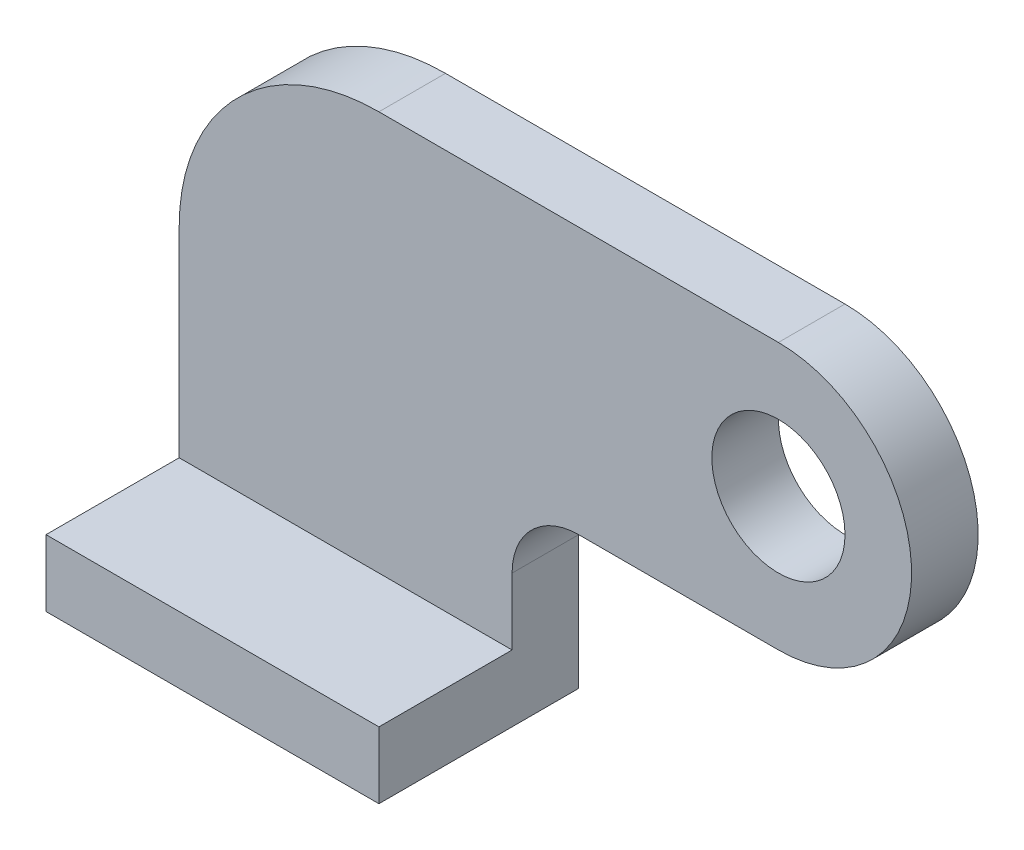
from build123d import *

# Parameters (mm, degrees)
SKETCH1_W           = 63.5
SKETCH1_H           = 12.7
BOSS_EXTRUDE1_DEPTH = 38.1
BOSS_EXTRUDE2_DEPTH = 12.7


with BuildPart() as part:
    # Sketch1 → Boss-Extrude1 (new body)
    with BuildSketch(Plane.XY):
        with Locations((31.75, 6.35)):
            Rectangle(SKETCH1_W, SKETCH1_H)
    extrude(amount=BOSS_EXTRUDE1_DEPTH)

    # Sketch1_4 → Boss-Extrude2 (add)
    with BuildSketch(Plane.XY):
        with BuildLine():
            Line((0, 50.8), (0, 12.7))
            Line((0, 12.7), (63.5, 12.7))
            Line((63.5, 12.7), (63.5, 25.4))
            ThreePointArc((63.5, 25.4), (67.219743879, 34.380256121), (76.2, 38.1))
            Line((76.2, 38.1), (114.3, 38.1))
            ThreePointArc((114.3, 38.1), (88.9, 63.5), (114.3, 88.9))
            Line((114.3, 88.9), (38.1, 88.9))
            ThreePointArc((38.1, 88.9), (11.159231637, 77.740768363), (0, 50.8))
        make_face()
        with BuildLine():
            ThreePointArc((139.7, 63.5), (132.260512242, 81.460512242), (114.3, 88.9))
            Line((114.3, 88.9), (114.3, 76.2))
            ThreePointArc((114.3, 76.2), (123.280256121, 72.480256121), (127, 63.5))
            ThreePointArc((127, 63.5), (123.280256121, 54.519743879), (114.3, 50.8))
            Line((114.3, 50.8), (114.3, 38.1))
            ThreePointArc((114.3, 38.1), (132.260512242, 45.539487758), (139.7, 63.5))
        make_face()
        with BuildLine():
            Line((114.3, 76.2), (114.3, 88.9))
            ThreePointArc((114.3, 88.9), (88.9, 63.5), (114.3, 38.1))
            Line((114.3, 38.1), (114.3, 50.8))
            ThreePointArc((114.3, 50.8), (101.6, 63.5), (114.3, 76.2))
        make_face()
        with BuildLine():
            ThreePointArc((139.7, 63.5), (132.260512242, 81.460512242), (114.3, 88.9))
            Line((114.3, 88.9), (114.3, 76.2))
            ThreePointArc((114.3, 76.2), (123.280256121, 72.480256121), (127, 63.5))
            ThreePointArc((127, 63.5), (123.280256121, 54.519743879), (114.3, 50.8))
            Line((114.3, 50.8), (114.3, 38.1))
            ThreePointArc((114.3, 38.1), (132.260512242, 45.539487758), (139.7, 63.5))
        make_face()
        with BuildLine():
            Line((114.3, 76.2), (114.3, 88.9))
            ThreePointArc((114.3, 88.9), (88.9, 63.5), (114.3, 38.1))
            Line((114.3, 38.1), (114.3, 50.8))
            ThreePointArc((114.3, 50.8), (101.6, 63.5), (114.3, 76.2))
        make_face()
    extrude(amount=BOSS_EXTRUDE2_DEPTH)


solid = part.part
